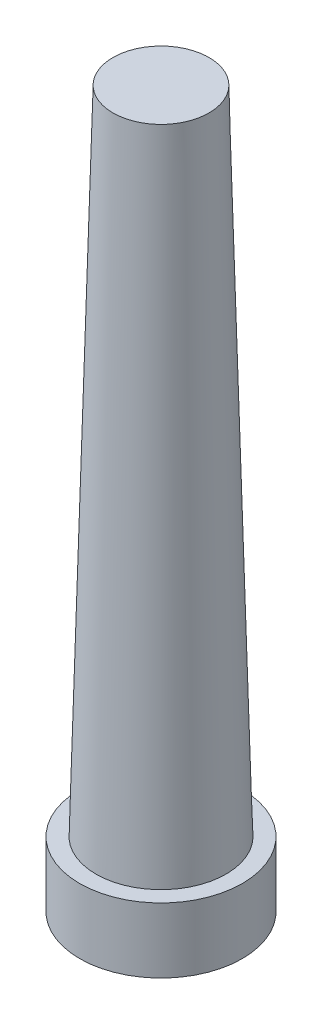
from build123d import *

# Parameters (mm, degrees)
SKETCH1_R           = 125
BOSS_EXTRUDE1_DEPTH = 100
SKETCH2_R           = 100
BOSS_EXTRUDE2_DEPTH = 1000
BOSS_EXTRUDE2_TAPER = 1.5


with BuildPart() as part:
    # Sketch1 → Boss-Extrude1 (new body)
    with BuildSketch(Plane(origin=(0, 0, 0), x_dir=(1, 0, 0), z_dir=(0, 1, 0))):
        with Locations(Location((0, 0, 0), (0, 0, 270))):
            Circle(SKETCH1_R)
    extrude(amount=BOSS_EXTRUDE1_DEPTH)

    # Sketch2 → Boss-Extrude2 (add)
    with BuildSketch(Plane(origin=(0, 100, 0), x_dir=(1, 0, 0), z_dir=(0, 1, 0))):
        Circle(SKETCH2_R)
    extrude(amount=BOSS_EXTRUDE2_DEPTH, taper=BOSS_EXTRUDE2_TAPER)


solid = part.part
